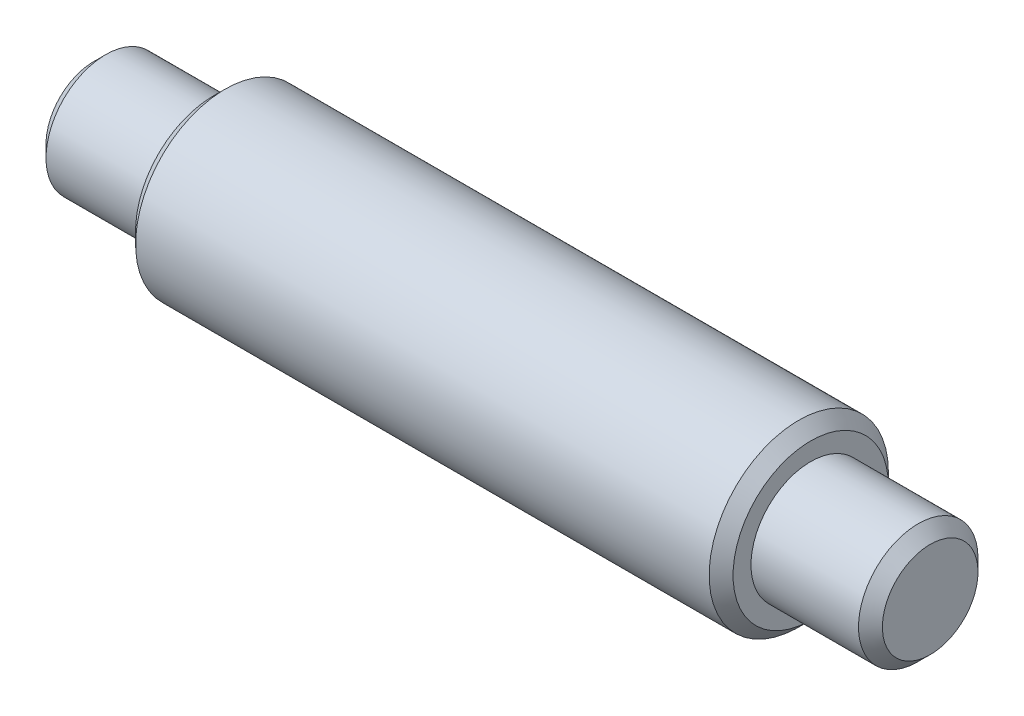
ISO-10303-21;
HEADER;
FILE_DESCRIPTION(('STEP AP214'),'2;1');
FILE_NAME('part.step','',(''),(''),'','','');
FILE_SCHEMA(('AUTOMOTIVE_DESIGN { 1 0 10303 214 1 1 1 1 }'));
ENDSEC;
DATA;
#1=APPLICATION_CONTEXT('core data for automotive mechanical design processes');
#2=APPLICATION_PROTOCOL_DEFINITION('international standard','automotive_design',2000,#1);
#3=PRODUCT_CONTEXT('',#1,'mechanical');
#4=PRODUCT('Part','Part','',(#3));
#5=PRODUCT_RELATED_PRODUCT_CATEGORY('part','',(#4));
#6=PRODUCT_DEFINITION_FORMATION('','',#4);
#7=PRODUCT_DEFINITION_CONTEXT('part definition',#1,'design');
#8=PRODUCT_DEFINITION('design','',#6,#7);
#9=PRODUCT_DEFINITION_SHAPE('','',#8);
#10=(LENGTH_UNIT() NAMED_UNIT(*) SI_UNIT(.MILLI.,.METRE.));
#11=(NAMED_UNIT(*) PLANE_ANGLE_UNIT() SI_UNIT($,.RADIAN.));
#12=(NAMED_UNIT(*) SI_UNIT($,.STERADIAN.) SOLID_ANGLE_UNIT());
#13=UNCERTAINTY_MEASURE_WITH_UNIT(LENGTH_MEASURE(1.E-05),#10,'distance_accuracy_value','');
#14=(GEOMETRIC_REPRESENTATION_CONTEXT(3) GLOBAL_UNCERTAINTY_ASSIGNED_CONTEXT((#13)) GLOBAL_UNIT_ASSIGNED_CONTEXT((#10,
#11,#12)) REPRESENTATION_CONTEXT('',''));
#15=CARTESIAN_POINT('',(0.,0.,0.));
#16=DIRECTION('',(0.,0.,1.));
#17=DIRECTION('',(1.,0.,0.));
#18=AXIS2_PLACEMENT_3D('',#15,#16,#17);
#19=CARTESIAN_POINT('',(25.,0.,0.));
#20=DIRECTION('',(-1.,0.,0.));
#21=DIRECTION('',(0.,0.,1.));
#22=AXIS2_PLACEMENT_3D('',#19,#20,#21);
#23=CYLINDRICAL_SURFACE('',#22,7.5);
#24=CARTESIAN_POINT('',(24.,0.,0.));
#25=DIRECTION('',(1.,0.,0.));
#26=DIRECTION('',(0.,0.,-1.));
#27=AXIS2_PLACEMENT_3D('',#24,#25,#26);
#28=CIRCLE('',#27,7.5);
#29=CARTESIAN_POINT('',(24.,0.,-7.5));
#30=VERTEX_POINT('',#29);
#31=EDGE_CURVE('E64',#30,#30,#28,.F.);
#32=ORIENTED_EDGE('',*,*,#31,.T.);
#33=EDGE_LOOP('',(#32));
#34=FACE_BOUND('',#33,.T.);
#35=CARTESIAN_POINT('',(-24.,0.,0.));
#36=DIRECTION('',(1.,0.,0.));
#37=DIRECTION('',(0.,0.,-1.));
#38=AXIS2_PLACEMENT_3D('',#35,#36,#37);
#39=CIRCLE('',#38,7.5);
#40=CARTESIAN_POINT('',(-24.,0.,-7.5));
#41=VERTEX_POINT('',#40);
#42=EDGE_CURVE('E67',#41,#41,#39,.T.);
#43=ORIENTED_EDGE('',*,*,#42,.T.);
#44=EDGE_LOOP('',(#43));
#45=FACE_BOUND('',#44,.T.);
#46=ADVANCED_FACE('F44',(#34,#45),#23,.T.);
#47=CARTESIAN_POINT('',(25.,0.,0.));
#48=DIRECTION('',(1.,0.,0.));
#49=DIRECTION('',(0.,0.,-1.));
#50=AXIS2_PLACEMENT_3D('',#47,#48,#49);
#51=PLANE('',#50);
#52=CARTESIAN_POINT('',(25.,0.,0.));
#53=DIRECTION('',(1.,0.,0.));
#54=DIRECTION('',(0.,0.,-1.));
#55=AXIS2_PLACEMENT_3D('',#52,#53,#54);
#56=CIRCLE('',#55,5.);
#57=CARTESIAN_POINT('',(25.,0.,-5.));
#58=VERTEX_POINT('',#57);
#59=EDGE_CURVE('E73',#58,#58,#56,.T.);
#60=ORIENTED_EDGE('',*,*,#59,.F.);
#61=EDGE_LOOP('',(#60));
#62=FACE_BOUND('',#61,.T.);
#63=CARTESIAN_POINT('',(25.,0.,0.));
#64=DIRECTION('',(1.,0.,0.));
#65=DIRECTION('',(0.,0.,-1.));
#66=AXIS2_PLACEMENT_3D('',#63,#64,#65);
#67=CIRCLE('',#66,6.49999999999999);
#68=CARTESIAN_POINT('',(25.,0.,-6.49999999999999));
#69=VERTEX_POINT('',#68);
#70=EDGE_CURVE('E70',#69,#69,#67,.T.);
#71=ORIENTED_EDGE('',*,*,#70,.T.);
#72=EDGE_LOOP('',(#71));
#73=FACE_BOUND('',#72,.T.);
#74=ADVANCED_FACE('F100',(#62,#73),#51,.T.);
#75=CARTESIAN_POINT('',(-25.,0.,0.));
#76=DIRECTION('',(1.,0.,0.));
#77=DIRECTION('',(0.,0.,-1.));
#78=AXIS2_PLACEMENT_3D('',#75,#76,#77);
#79=PLANE('',#78);
#80=CARTESIAN_POINT('',(-25.,0.,0.));
#81=DIRECTION('',(1.,0.,0.));
#82=DIRECTION('',(0.,0.,-1.));
#83=AXIS2_PLACEMENT_3D('',#80,#81,#82);
#84=CIRCLE('',#83,5.);
#85=CARTESIAN_POINT('',(-25.,0.,-5.));
#86=VERTEX_POINT('',#85);
#87=EDGE_CURVE('E12',#86,#86,#84,.F.);
#88=ORIENTED_EDGE('',*,*,#87,.F.);
#89=EDGE_LOOP('',(#88));
#90=FACE_BOUND('',#89,.T.);
#91=CARTESIAN_POINT('',(-25.,0.,0.));
#92=DIRECTION('',(1.,0.,0.));
#93=DIRECTION('',(0.,0.,-1.));
#94=AXIS2_PLACEMENT_3D('',#91,#92,#93);
#95=CIRCLE('',#94,6.49999999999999);
#96=CARTESIAN_POINT('',(-25.,0.,-6.49999999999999));
#97=VERTEX_POINT('',#96);
#98=EDGE_CURVE('E59',#97,#97,#95,.F.);
#99=ORIENTED_EDGE('',*,*,#98,.T.);
#100=EDGE_LOOP('',(#99));
#101=FACE_BOUND('',#100,.T.);
#102=ADVANCED_FACE('F106',(#90,#101),#79,.F.);
#103=CARTESIAN_POINT('',(25.,0.,0.));
#104=DIRECTION('',(-1.,0.,0.));
#105=DIRECTION('',(0.,0.,1.));
#106=AXIS2_PLACEMENT_3D('',#103,#104,#105);
#107=CONICAL_SURFACE('',#106,6.49999999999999,0.785398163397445);
#108=ORIENTED_EDGE('',*,*,#31,.F.);
#109=EDGE_LOOP('',(#108));
#110=FACE_BOUND('',#109,.T.);
#111=ORIENTED_EDGE('',*,*,#70,.F.);
#112=EDGE_LOOP('',(#111));
#113=FACE_BOUND('',#112,.T.);
#114=ADVANCED_FACE('F112',(#110,#113),#107,.T.);
#115=CARTESIAN_POINT('',(-24.,0.,0.));
#116=DIRECTION('',(1.,0.,0.));
#117=DIRECTION('',(0.,0.,-1.));
#118=AXIS2_PLACEMENT_3D('',#115,#116,#117);
#119=CONICAL_SURFACE('',#118,7.5,0.785398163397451);
#120=ORIENTED_EDGE('',*,*,#98,.F.);
#121=EDGE_LOOP('',(#120));
#122=FACE_BOUND('',#121,.T.);
#123=ORIENTED_EDGE('',*,*,#42,.F.);
#124=EDGE_LOOP('',(#123));
#125=FACE_BOUND('',#124,.T.);
#126=ADVANCED_FACE('F114',(#122,#125),#119,.T.);
#127=CARTESIAN_POINT('',(35.,0.,0.));
#128=DIRECTION('',(-1.,0.,0.));
#129=DIRECTION('',(0.,0.,1.));
#130=AXIS2_PLACEMENT_3D('',#127,#128,#129);
#131=CYLINDRICAL_SURFACE('',#130,5.);
#132=CARTESIAN_POINT('',(34.,0.,0.));
#133=DIRECTION('',(1.,0.,0.));
#134=DIRECTION('',(0.,0.,-1.));
#135=AXIS2_PLACEMENT_3D('',#132,#133,#134);
#136=CIRCLE('',#135,5.);
#137=CARTESIAN_POINT('',(34.,0.,-5.));
#138=VERTEX_POINT('',#137);
#139=EDGE_CURVE('E51',#138,#138,#136,.F.);
#140=ORIENTED_EDGE('',*,*,#139,.T.);
#141=EDGE_LOOP('',(#140));
#142=FACE_BOUND('',#141,.T.);
#143=ORIENTED_EDGE('',*,*,#59,.T.);
#144=EDGE_LOOP('',(#143));
#145=FACE_BOUND('',#144,.T.);
#146=ADVANCED_FACE('F117',(#142,#145),#131,.T.);
#147=CARTESIAN_POINT('',(35.,0.,0.));
#148=DIRECTION('',(1.,0.,0.));
#149=DIRECTION('',(0.,0.,-1.));
#150=AXIS2_PLACEMENT_3D('',#147,#148,#149);
#151=PLANE('',#150);
#152=CARTESIAN_POINT('',(35.,0.,0.));
#153=DIRECTION('',(1.,0.,0.));
#154=DIRECTION('',(0.,0.,-1.));
#155=AXIS2_PLACEMENT_3D('',#152,#153,#154);
#156=CIRCLE('',#155,4.);
#157=CARTESIAN_POINT('',(35.,0.,-4.));
#158=VERTEX_POINT('',#157);
#159=EDGE_CURVE('E55',#158,#158,#156,.T.);
#160=ORIENTED_EDGE('',*,*,#159,.T.);
#161=EDGE_LOOP('',(#160));
#162=FACE_BOUND('',#161,.T.);
#163=ADVANCED_FACE('F96',(#162),#151,.T.);
#164=CARTESIAN_POINT('',(35.,0.,0.));
#165=DIRECTION('',(-1.,0.,0.));
#166=DIRECTION('',(0.,0.,1.));
#167=AXIS2_PLACEMENT_3D('',#164,#165,#166);
#168=CONICAL_SURFACE('',#167,4.,0.785398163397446);
#169=ORIENTED_EDGE('',*,*,#139,.F.);
#170=EDGE_LOOP('',(#169));
#171=FACE_BOUND('',#170,.T.);
#172=ORIENTED_EDGE('',*,*,#159,.F.);
#173=EDGE_LOOP('',(#172));
#174=FACE_BOUND('',#173,.T.);
#175=ADVANCED_FACE('F46',(#171,#174),#168,.T.);
#176=CARTESIAN_POINT('',(-35.,0.,0.));
#177=DIRECTION('',(1.,0.,0.));
#178=DIRECTION('',(0.,0.,1.));
#179=AXIS2_PLACEMENT_3D('',#176,#177,#178);
#180=CYLINDRICAL_SURFACE('',#179,5.);
#181=CARTESIAN_POINT('',(-34.,0.,0.));
#182=DIRECTION('',(1.,0.,0.));
#183=DIRECTION('',(0.,0.,-1.));
#184=AXIS2_PLACEMENT_3D('',#181,#182,#183);
#185=CIRCLE('',#184,5.);
#186=CARTESIAN_POINT('',(-34.,0.,-5.));
#187=VERTEX_POINT('',#186);
#188=EDGE_CURVE('E79',#187,#187,#185,.F.);
#189=ORIENTED_EDGE('',*,*,#188,.F.);
#190=EDGE_LOOP('',(#189));
#191=FACE_BOUND('',#190,.T.);
#192=ORIENTED_EDGE('',*,*,#87,.T.);
#193=EDGE_LOOP('',(#192));
#194=FACE_BOUND('',#193,.T.);
#195=ADVANCED_FACE('F86',(#191,#194),#180,.T.);
#196=CARTESIAN_POINT('',(-35.,0.,0.));
#197=DIRECTION('',(-1.,0.,0.));
#198=DIRECTION('',(0.,0.,-1.));
#199=AXIS2_PLACEMENT_3D('',#196,#197,#198);
#200=PLANE('',#199);
#201=CARTESIAN_POINT('',(-35.,0.,0.));
#202=DIRECTION('',(1.,0.,0.));
#203=DIRECTION('',(0.,0.,-1.));
#204=AXIS2_PLACEMENT_3D('',#201,#202,#203);
#205=CIRCLE('',#204,4.);
#206=CARTESIAN_POINT('',(-35.,0.,-4.));
#207=VERTEX_POINT('',#206);
#208=EDGE_CURVE('E76',#207,#207,#205,.T.);
#209=ORIENTED_EDGE('',*,*,#208,.F.);
#210=EDGE_LOOP('',(#209));
#211=FACE_BOUND('',#210,.T.);
#212=ADVANCED_FACE('F88',(#211),#200,.T.);
#213=CARTESIAN_POINT('',(-35.,0.,0.));
#214=DIRECTION('',(1.,0.,0.));
#215=DIRECTION('',(0.,0.,1.));
#216=AXIS2_PLACEMENT_3D('',#213,#214,#215);
#217=CONICAL_SURFACE('',#216,4.,0.785398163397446);
#218=ORIENTED_EDGE('',*,*,#188,.T.);
#219=EDGE_LOOP('',(#218));
#220=FACE_BOUND('',#219,.T.);
#221=ORIENTED_EDGE('',*,*,#208,.T.);
#222=EDGE_LOOP('',(#221));
#223=FACE_BOUND('',#222,.T.);
#224=ADVANCED_FACE('F83',(#220,#223),#217,.T.);
#225=CLOSED_SHELL('',(#46,#74,#102,#114,#126,#146,#163,#175,#195,#212,#224));
#226=MANIFOLD_SOLID_BREP('B2',#225);
#227=ADVANCED_BREP_SHAPE_REPRESENTATION('',(#18,#226),#14);
#228=SHAPE_DEFINITION_REPRESENTATION(#9,#227);
ENDSEC;
END-ISO-10303-21;
